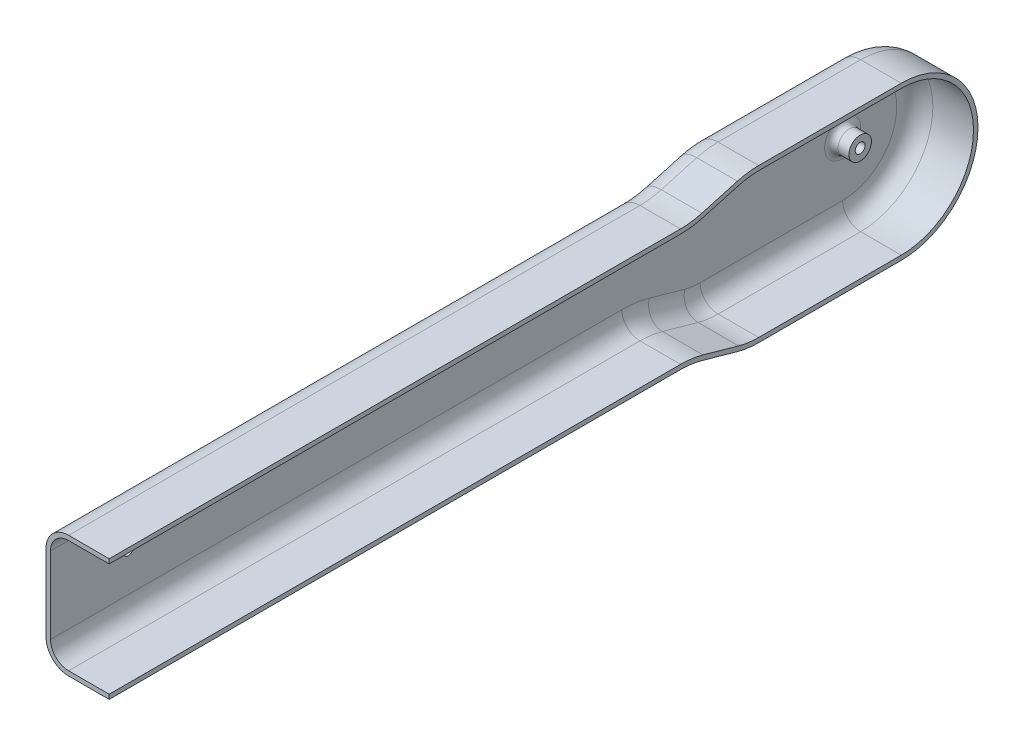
from build123d import *

# Parameters (mm, degrees)
SKETCH1_W           = 54
SKETCH1_H           = 28
BOSS_EXTRUDE1_DEPTH = 283
BOSS_EXTRUDE2_DEPTH = 28
FILLET4_R           = 35
FILLET5_R           = 10
SHELL2_T            = -2
CUT_EXTRUDE2_DEPTH  = 385.760964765
SKETCH5_R           = 2.1
CUT_EXTRUDE3_DEPTH  = 287.407052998
SKETCH6_R           = 5
BOSS_EXTRUDE3_DEPTH = 7.8
FILLET6_R           = 3
SKETCH7_R           = 2.2
CUT_EXTRUDE4_DEPTH  = 286.615545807


with BuildPart() as part:
    # Sketch1 → Boss-Extrude1 (new body)
    with BuildSketch(Plane(origin=(0, 0, 0), x_dir=(0, 1, 0), z_dir=(0, 0, 1))):
        Rectangle(SKETCH1_W, SKETCH1_H)
    extrude(amount=BOSS_EXTRUDE1_DEPTH)

    # Sketch2 → Boss-Extrude2 (add)
    with BuildSketch(Plane(origin=(-14, 0, 0), x_dir=(0, -1, 0), z_dir=(-1, 0, 0))):
        with BuildLine():
            Line((-34, 0), (-34, -68))
            ThreePointArc((-34, -68), (0, -102), (34, -68))
            Line((34, -68), (34, 0))
            Line((34, 0), (27, 25))
            Line((27, 25), (-27, 25))
            Line((-27, 25), (-34, 0))
        make_face()
    extrude(amount=-BOSS_EXTRUDE2_DEPTH)

    # Fillet4
    fillet4_edges = [part.edges().sort_by_distance(p)[0] for p in [
        (0, 34, 0),
        (0, 27, 25),
        (0, -27, 25),
        (0, -34, 0),
    ]]
    fillet(fillet4_edges, radius=FILLET4_R)

    # Fillet5
    fillet5_edges = [part.edges().sort_by_distance(p)[0] for p in [
        (-14, 0, -102),
        (-14, -34, -36.403774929),
        (-14, -30.5, 12.5),
        (-14, 30.5, 12.5),
        (-14, 34, -36.403774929),
        (-14, 33.674420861, -0.044721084),
        (-14, -33.674420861, -0.044721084),
        (-14, -27.325579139, 25.044721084),
        (-14, 27.325579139, 25.044721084),
        (-14, -27, 156.403774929),
        (-14, 27, 156.403774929),
    ]]
    fillet(fillet5_edges, radius=FILLET5_R)

    # Shell2
    shell2_openings = [part.faces().sort_by_distance(p)[0] for p in [
        (14, 0, 84.807576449),
    ]]
    offset(amount=SHELL2_T, openings=shell2_openings, kind=Kind.INTERSECTION)

    # Sketch4 → Cut-Extrude2 (cut, through all)
    with BuildSketch(Plane(origin=(0, 0, 281), x_dir=(1, 0, 0), z_dir=(0, 0, -1))):
        with BuildLine():
            Line((-12, 17), (-12, -17))
            ThreePointArc((-12, -17), (-9.656854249, -22.656854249), (-4, -25))
            Line((-4, -25), (14, -25))
            Line((14, -25), (14, 25))
            Line((14, 25), (-4, 25))
            ThreePointArc((-4, 25), (-9.656854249, 22.656854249), (-12, 17))
        make_face()
    extrude(amount=-CUT_EXTRUDE2_DEPTH, mode=Mode.SUBTRACT)

    # Sketch5 → Cut-Extrude3 (cut, through all)
    with BuildSketch(Plane(origin=(-14, 0, 0), x_dir=(0, -1, 0), z_dir=(-1, 0, 0))):
        with Locations(Location((0, 248.5, 0), (0, 0, 90))):
            Circle(SKETCH5_R)
    extrude(amount=-CUT_EXTRUDE3_DEPTH, mode=Mode.SUBTRACT)

    # Sketch6 → Boss-Extrude3 (add)
    with BuildSketch(Plane.YZ.offset(-12)):
        with Locations(Location((0, -68, 0), (0, 0, 270))):
            Circle(SKETCH6_R)
    extrude(amount=BOSS_EXTRUDE3_DEPTH)

    # Fillet6
    fillet6_edges = [part.edges().sort_by_distance(p)[0] for p in [
        (-12, 0, -63),
    ]]
    fillet(fillet6_edges, radius=FILLET6_R)

    # Sketch7 → Cut-Extrude4 (cut, through all)
    with BuildSketch(Plane.YZ.offset(-4.2)):
        with Locations(Location((0, -68, 0), (0, 0, 270))):
            Circle(SKETCH7_R)
    extrude(amount=-CUT_EXTRUDE4_DEPTH, mode=Mode.SUBTRACT)


solid = part.part
